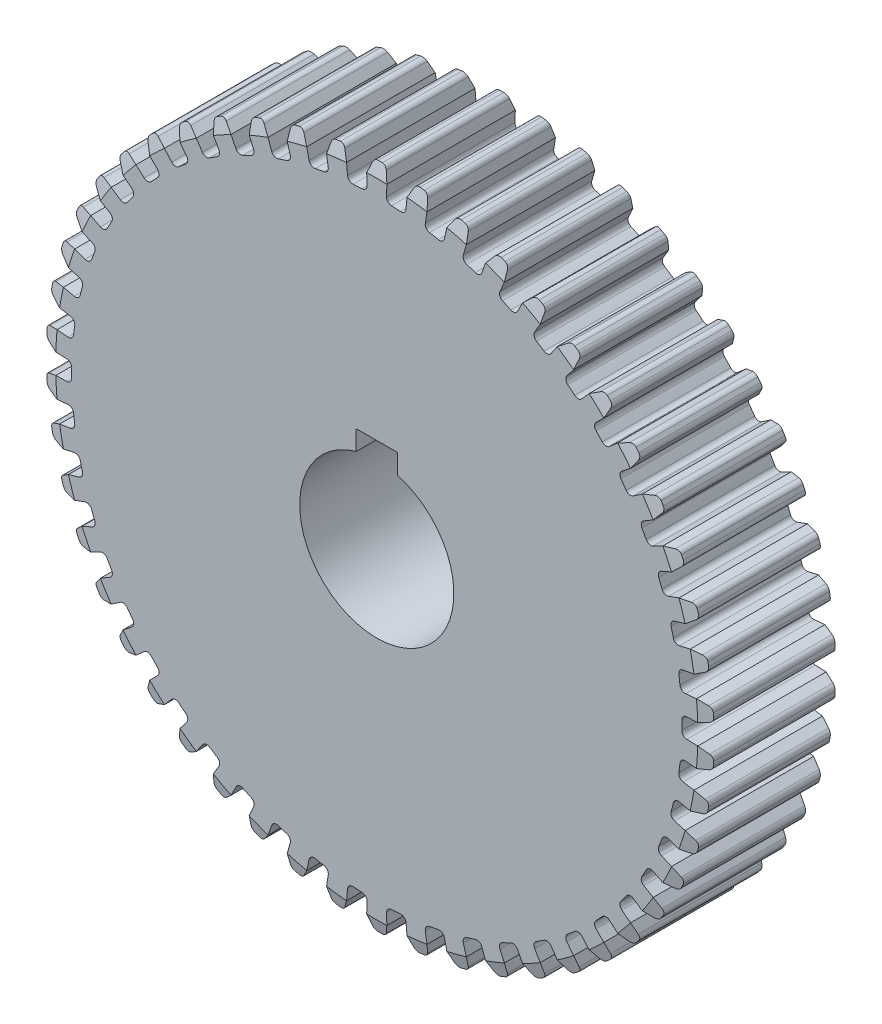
from build123d import *

# Parameters (mm, degrees)
SKETCH2_R          = 70
CUT_EXTRUDE1_DEPTH = 25
CUT_EXTRUDE2_DEPTH = 34
SKETCH5_R          = 31.080505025
CUT_EXTRUDE3_DEPTH = 15.875


with BuildPart() as part:
    # Sketch1 → Revolve1 (revolve)
    with BuildSketch(Plane(origin=(0, 0, 0), x_dir=(0, 0, -1), z_dir=(1, 0, 0)), mode=Mode.PRIVATE) as revolve1_sk:
        Polygon((-34, 15.3), (-33.7, 15), (-0.3, 15), (0, 15.3), (0, 62.5), (-1.205771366, 67), (-23.794228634, 67), (-25, 62.5), (-25, 22), (-33.5, 22), (-34, 21.5), align=None)
    revolve(revolve1_sk.sketch.rotate(Axis((0, 0, 0), (0, 0, 1)), 270), axis=Axis((0, 0, 0), (0, 0, 1)))

    # Sketch2 → Cut-Extrude1 (cut)
    with BuildSketch(Plane.XY):
        Circle(SKETCH2_R)
        with BuildLine():
            Line((-64.09888963, -5.393038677), (-62.222622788, -5.881769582))
            Line((-62.222622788, -5.881769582), (-60.098808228, -5.681009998))
            ThreePointArc((-60.098808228, -5.681009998), (-59.373679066, -5.90080609), (-59.010833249, -6.56598692))
            ThreePointArc((-59.010833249, -6.56598692), (-58.906810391, -7.441660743), (-58.789793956, -8.315693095))
            ThreePointArc((-58.789793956, -8.315693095), (-58.975816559, -9.050212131), (-59.623503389, -9.443435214))
            Line((-59.623503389, -9.443435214), (-61.730521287, -9.777154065))
            Line((-61.730521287, -9.777154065), (-63.426299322, -10.717139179))
            ThreePointArc((-63.426299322, -10.717139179), (-63.845702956, -11.16467764), (-63.924950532, -11.772879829))
            ThreePointArc((-63.924950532, -11.772879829), (-63.848671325, -12.179785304), (-63.769802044, -12.586196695))
            ThreePointArc((-63.769802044, -12.586196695), (-63.472225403, -13.122515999), (-62.917523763, -13.384234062))
            Line((-62.917523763, -13.384234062), (-60.994797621, -13.633952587))
            Line((-60.994797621, -13.633952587), (-58.912891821, -13.168591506))
            ThreePointArc((-58.912891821, -13.168591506), (-58.165932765, -13.295771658), (-57.722578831, -13.910230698))
            ThreePointArc((-57.722578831, -13.910230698), (-57.509625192, -14.76596205), (-57.283986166, -15.618436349))
            ThreePointArc((-57.283986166, -15.618436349), (-57.376482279, -16.370478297), (-57.969777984, -16.841777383))
            Line((-57.969777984, -16.841777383), (-60.018355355, -17.436944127))
            Line((-60.018355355, -17.436944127), (-61.5829503, -18.582054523))
            ThreePointArc((-61.5829503, -18.582054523), (-61.942955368, -19.078629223), (-61.945350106, -19.691967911))
            ThreePointArc((-61.945350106, -19.691967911), (-61.818673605, -20.086104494), (-61.689489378, -20.479426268))
            ThreePointArc((-61.689489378, -20.479426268), (-61.327040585, -20.974220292), (-60.743910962, -21.16435208))
            Line((-60.743910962, -21.16435208), (-58.80504806, -21.171120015))
            Line((-58.80504806, -21.171120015), (-56.797883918, -20.448496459))
            ThreePointArc((-56.797883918, -20.448496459), (-56.040874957, -20.481054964), (-55.524004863, -21.035101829))
            ThreePointArc((-55.524004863, -21.035101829), (-55.20547885, -21.857395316), (-54.874775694, -22.674867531))
            ThreePointArc((-54.874775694, -22.674867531), (-54.872286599, -23.432572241), (-55.401834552, -23.974514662))
            Line((-55.401834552, -23.974514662), (-57.359664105, -24.821743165))
            Line((-57.359664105, -24.821743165), (-58.768401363, -26.153919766))
            ThreePointArc((-58.768401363, -26.153919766), (-59.063330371, -26.691699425), (-58.988834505, -27.300501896))
            ThreePointArc((-58.988834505, -27.300501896), (-58.813758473, -27.675653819), (-58.636296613, -28.049683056))
            ThreePointArc((-58.636296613, -28.049683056), (-58.214691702, -28.495148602), (-57.612330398, -28.610695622))
            Line((-57.612330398, -28.610695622), (-55.687907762, -28.374406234))
            Line((-55.687907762, -28.374406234), (-53.787139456, -27.405916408))
            ThreePointArc((-53.787139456, -27.405916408), (-53.032019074, -27.343339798), (-52.44978417, -27.828236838))
            ThreePointArc((-52.44978417, -27.828236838), (-52.030708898, -28.604124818), (-51.600156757, -29.373703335))
            ThreePointArc((-51.600156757, -29.373703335), (-51.502722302, -30.125120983), (-51.960171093, -30.729159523))
            Line((-51.960171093, -30.729159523), (-53.796376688, -31.815088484))
            Line((-53.796376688, -31.815088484), (-55.02703963, -33.313322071))
            ThreePointArc((-55.02703963, -33.313322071), (-55.252241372, -33.883825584), (-55.102029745, -34.478490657))
            ThreePointArc((-55.102029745, -34.478490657), (-54.881315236, -34.828741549), (-54.658374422, -35.177579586))
            ThreePointArc((-54.658374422, -35.177579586), (-54.184262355, -35.566691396), (-53.572168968, -35.605831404))
            Line((-53.572168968, -35.605831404), (-51.692535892, -35.130211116))
            Line((-51.692535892, -35.130211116), (-49.928139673, -33.931128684))
            ThreePointArc((-49.928139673, -33.931128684), (-49.18681657, -33.77440383), (-48.548399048, -34.182503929))
            ThreePointArc((-48.548399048, -34.182503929), (-48.035384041, -34.899749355), (-47.51177346, -35.609296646))
            ThreePointArc((-47.51177346, -35.609296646), (-47.320929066, -36.342577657), (-47.699064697, -36.999187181))
            Line((-47.699064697, -36.999187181), (-49.384688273, -38.306690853))
            Line((-49.384688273, -38.306690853), (-50.417868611, -39.947353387))
            ThreePointArc((-50.417868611, -39.947353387), (-50.569791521, -40.541583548), (-50.346233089, -41.112732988))
            ThreePointArc((-50.346233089, -41.112732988), (-50.083360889, -41.432559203), (-49.818457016, -41.750704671))
            ThreePointArc((-49.818457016, -41.750704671), (-49.299314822, -42.07732622), (-48.687142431, -42.039441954))
            Line((-48.687142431, -42.039441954), (-46.881941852, -41.331991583))
            Line((-46.881941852, -41.331991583), (-45.281743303, -39.92122679))
            ThreePointArc((-45.281743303, -39.92122679), (-44.565908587, -39.672825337), (-43.881376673, -39.997692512))
            ThreePointArc((-43.881376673, -39.997692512), (-43.282512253, -40.644984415), (-42.674100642, -41.283310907))
            ThreePointArc((-42.674100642, -41.283310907), (-42.392856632, -41.986890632), (-42.685715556, -42.685715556))
            Line((-42.685715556, -42.685715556), (-44.194173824, -44.194173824))
            Line((-44.194173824, -44.194173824), (-45.013577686, -45.951391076))
            ThreePointArc((-45.013577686, -45.951391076), (-45.08982585, -46.559976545), (-44.796446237, -47.098603))
            ThreePointArc((-44.796446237, -47.098603), (-44.495562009, -47.382960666), (-44.192872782, -47.665396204))
            ThreePointArc((-44.192872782, -47.665396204), (-43.636887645, -47.924376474), (-43.034290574, -47.810065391))
            Line((-43.034290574, -47.810065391), (-41.331991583, -46.881941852))
            Line((-41.331991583, -46.881941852), (-39.92122679, -45.281743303))
            ThreePointArc((-39.92122679, -45.281743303), (-39.242169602, -44.945582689), (-38.522318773, -45.182093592))
            ThreePointArc((-38.522318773, -45.182093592), (-37.847049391, -45.74922379), (-37.163431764, -46.306262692))
            ThreePointArc((-37.163431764, -46.306262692), (-36.796223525, -46.96904526), (-36.999187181, -47.699064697))
            Line((-36.999187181, -47.699064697), (-38.306690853, -49.384688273))
            Line((-38.306690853, -49.384688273), (-38.899395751, -51.230747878))
            ThreePointArc((-38.899395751, -51.230747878), (-38.898766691, -51.844090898), (-38.540192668, -52.341699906))
            ThreePointArc((-38.540192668, -52.341699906), (-38.206041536, -52.586104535), (-37.870340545, -52.828375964))
            ThreePointArc((-37.870340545, -52.828375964), (-37.286280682, -53.015630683), (-36.702762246, -52.826695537))
            Line((-36.702762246, -52.826695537), (-35.130211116, -51.692535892))
            Line((-35.130211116, -51.692535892), (-33.931128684, -49.928139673))
            ThreePointArc((-33.931128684, -49.928139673), (-33.299558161, -49.509521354), (-32.555740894, -49.653946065))
            ThreePointArc((-32.555740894, -49.653946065), (-31.814715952, -50.131970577), (-31.066673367, -50.598937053))
            ThreePointArc((-31.066673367, -50.598937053), (-30.619291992, -51.210469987), (-30.729159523, -51.960171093))
            Line((-30.729159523, -51.960171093), (-31.815088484, -53.796376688))
            Line((-31.815088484, -53.796376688), (-32.171747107, -55.702165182))
            ThreePointArc((-32.171747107, -55.702165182), (-32.094250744, -56.310592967), (-31.676137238, -56.759336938))
            ThreePointArc((-31.676137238, -56.759336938), (-31.313988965, -56.959934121), (-30.950570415, -57.158220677))
            ThreePointArc((-30.950570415, -57.158220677), (-30.347646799, -57.270796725), (-29.792409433, -57.010217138))
            Line((-29.792409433, -57.010217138), (-28.374406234, -55.687907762))
            Line((-28.374406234, -55.687907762), (-27.405916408, -53.787139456))
            ThreePointArc((-27.405916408, -53.787139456), (-26.831792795, -53.292665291), (-26.075739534, -53.342726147))
            ThreePointArc((-26.075739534, -53.342726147), (-25.280645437, -53.72410624), (-24.479974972, -54.093635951))
            ThreePointArc((-24.479974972, -54.093635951), (-23.959475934, -54.64427501), (-23.974514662, -55.401834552))
            Line((-23.974514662, -55.401834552), (-24.821743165, -57.359664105))
            Line((-24.821743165, -57.359664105), (-24.936730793, -59.295126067))
            ThreePointArc((-24.936730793, -59.295126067), (-24.783589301, -59.88904333), (-24.312530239, -60.281845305))
            ThreePointArc((-24.312530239, -60.281845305), (-23.928096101, -60.435471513), (-23.542691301, -60.586646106))
            ThreePointArc((-23.542691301, -60.586646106), (-22.930412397, -60.622768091), (-22.412212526, -60.294653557))
            Line((-22.412212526, -60.294653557), (-21.171120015, -58.80504806))
            Line((-21.171120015, -58.80504806), (-20.448496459, -56.797883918))
            ThreePointArc((-20.448496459, -56.797883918), (-19.940874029, -56.23535206), (-19.184508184, -56.190259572))
            ThreePointArc((-19.184508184, -56.190259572), (-18.347884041, -56.468980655), (-17.507212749, -56.735245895))
            ThreePointArc((-17.507212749, -56.735245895), (-16.921804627, -57.216307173), (-16.841777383, -57.969777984))
            Line((-16.841777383, -57.969777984), (-17.436944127, -60.018355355))
            Line((-17.436944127, -60.018355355), (-17.308447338, -61.952967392))
            ThreePointArc((-17.308447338, -61.952967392), (-17.082075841, -62.523007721), (-16.565500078, -62.853672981))
            ThreePointArc((-16.565500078, -62.853672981), (-16.16484285, -62.957905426), (-15.763529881, -63.059583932))
            ThreePointArc((-15.763529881, -63.059583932), (-15.151551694, -63.018682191), (-14.678561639, -62.628207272))
            Line((-14.678561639, -62.628207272), (-13.633952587, -60.994797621))
            Line((-13.633952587, -60.994797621), (-13.168591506, -58.912891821))
            ThreePointArc((-13.168591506, -58.912891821), (-12.735475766, -58.291173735), (-11.99072568, -58.151639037))
            ThreePointArc((-11.99072568, -58.151639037), (-11.125765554, -58.323305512), (-10.258351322, -58.48210712))
            ThreePointArc((-10.258351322, -58.48210712), (-9.617266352, -58.886003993), (-9.443435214, -59.623503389))
            Line((-9.443435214, -59.623503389), (-9.777154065, -61.730521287))
            Line((-9.777154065, -61.730521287), (-9.407199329, -63.633773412))
            ThreePointArc((-9.407199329, -63.633773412), (-9.111167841, -64.170946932), (-8.557222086, -64.434260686))
            ThreePointArc((-8.557222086, -64.434260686), (-8.14666037, -64.487455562), (-7.735768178, -64.53803445))
            ThreePointArc((-7.735768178, -64.53803445), (-7.133741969, -64.420754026), (-6.713421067, -63.974076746))
            Line((-6.713421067, -63.974076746), (-5.881769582, -62.222622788))
            Line((-5.881769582, -62.222622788), (-5.681009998, -60.098808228))
            ThreePointArc((-5.681009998, -60.098808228), (-5.329231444, -59.427708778), (-4.607842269, -59.195932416))
            ThreePointArc((-4.607842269, -59.195932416), (-3.728187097, -59.257837), (-2.847709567, -59.306670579))
            ThreePointArc((-2.847709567, -59.306670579), (-2.161058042, -59.627033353), (-1.896164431, -60.336930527))
            Line((-1.896164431, -60.336930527), (-1.963172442, -62.469160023))
            Line((-1.963172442, -62.469160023), (-1.357594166, -64.311036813))
            ThreePointArc((-1.357594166, -64.311036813), (-0.996571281, -64.806871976), (-0.41399159, -64.998681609))
            ThreePointArc((-0.41399159, -64.998681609), (-1.9e-07, -65), (0.41399121, -64.998681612))
            ThreePointArc((0.41399121, -64.998681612), (0.996571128, -64.806872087), (1.357594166, -64.311036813))
            Line((1.357594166, -64.311036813), (1.963172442, -62.469160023))
            Line((1.963172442, -62.469160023), (1.896164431, -60.336930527))
            ThreePointArc((1.896164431, -60.336930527), (2.161058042, -59.627033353), (2.847709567, -59.306670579))
            ThreePointArc((2.847709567, -59.306670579), (3.728187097, -59.257837), (4.607842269, -59.195932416))
            ThreePointArc((4.607842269, -59.195932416), (5.329231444, -59.427708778), (5.681009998, -60.098808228))
            Line((5.681009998, -60.098808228), (5.881769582, -62.222622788))
            Line((5.881769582, -62.222622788), (6.713421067, -63.974076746))
            ThreePointArc((6.713421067, -63.974076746), (7.133741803, -64.420753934), (7.735767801, -64.538034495))
            ThreePointArc((7.735767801, -64.538034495), (8.146659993, -64.487455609), (8.55722171, -64.434260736))
            ThreePointArc((8.55722171, -64.434260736), (9.111167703, -64.170947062), (9.407199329, -63.633773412))
            Line((9.407199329, -63.633773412), (9.777154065, -61.730521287))
            Line((9.777154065, -61.730521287), (9.443435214, -59.623503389))
            ThreePointArc((9.443435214, -59.623503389), (9.617266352, -58.886003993), (10.258351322, -58.48210712))
            ThreePointArc((10.258351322, -58.48210712), (11.125765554, -58.323305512), (11.99072568, -58.151639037))
            ThreePointArc((11.99072568, -58.151639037), (12.735475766, -58.291173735), (13.168591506, -58.912891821))
            Line((13.168591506, -58.912891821), (13.633952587, -60.994797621))
            Line((13.633952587, -60.994797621), (14.678561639, -62.628207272))
            ThreePointArc((14.678561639, -62.628207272), (15.151551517, -63.01868212), (15.763529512, -63.059584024))
            ThreePointArc((15.763529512, -63.059584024), (16.164842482, -62.957905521), (16.565499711, -62.853673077))
            ThreePointArc((16.565499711, -62.853673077), (17.08207572, -62.523007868), (17.308447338, -61.952967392))
            Line((17.308447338, -61.952967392), (17.436944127, -60.018355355))
            Line((17.436944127, -60.018355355), (16.841777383, -57.969777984))
            ThreePointArc((16.841777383, -57.969777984), (16.921804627, -57.216307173), (17.507212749, -56.735245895))
            ThreePointArc((17.507212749, -56.735245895), (18.347884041, -56.468980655), (19.184508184, -56.190259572))
            ThreePointArc((19.184508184, -56.190259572), (19.940874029, -56.23535206), (20.448496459, -56.797883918))
            Line((20.448496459, -56.797883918), (21.171120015, -58.80504806))
            Line((21.171120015, -58.80504806), (22.412212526, -60.294653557))
            ThreePointArc((22.412212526, -60.294653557), (22.930412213, -60.622768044), (23.542690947, -60.586646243))
            ThreePointArc((23.542690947, -60.586646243), (23.928095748, -60.435471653), (24.312529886, -60.281845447))
            ThreePointArc((24.312529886, -60.281845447), (24.783589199, -59.88904349), (24.936730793, -59.295126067))
            Line((24.936730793, -59.295126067), (24.821743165, -57.359664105))
            Line((24.821743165, -57.359664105), (23.974514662, -55.401834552))
            ThreePointArc((23.974514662, -55.401834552), (23.959475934, -54.64427501), (24.479974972, -54.093635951))
            ThreePointArc((24.479974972, -54.093635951), (25.280645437, -53.72410624), (26.075739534, -53.342726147))
            ThreePointArc((26.075739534, -53.342726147), (26.831792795, -53.292665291), (27.405916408, -53.787139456))
            Line((27.405916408, -53.787139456), (28.374406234, -55.687907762))
            Line((28.374406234, -55.687907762), (29.792409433, -57.010217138))
            ThreePointArc((29.792409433, -57.010217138), (30.347646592, -57.270796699), (30.950570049, -57.158220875))
            ThreePointArc((30.950570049, -57.158220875), (31.313988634, -56.959934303), (31.676136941, -56.759337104))
            ThreePointArc((31.676136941, -56.759337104), (32.094250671, -56.310593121), (32.171747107, -55.702165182))
            Line((32.171747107, -55.702165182), (31.815088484, -53.796376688))
            Line((31.815088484, -53.796376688), (30.729159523, -51.960171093))
            ThreePointArc((30.729159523, -51.960171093), (30.619291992, -51.210469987), (31.066673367, -50.598937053))
            ThreePointArc((31.066673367, -50.598937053), (31.814715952, -50.131970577), (32.555740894, -49.653946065))
            ThreePointArc((32.555740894, -49.653946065), (33.299558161, -49.509521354), (33.931128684, -49.928139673))
            Line((33.931128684, -49.928139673), (35.130211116, -51.692535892))
            Line((35.130211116, -51.692535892), (36.702762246, -52.826695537))
            ThreePointArc((36.702762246, -52.826695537), (37.28628089, -53.015630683), (37.870340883, -52.828375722))
            ThreePointArc((37.870340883, -52.828375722), (38.206041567, -52.586104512), (38.540192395, -52.341700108))
            ThreePointArc((38.540192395, -52.341700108), (38.898766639, -51.844091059), (38.899395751, -51.230747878))
            Line((38.899395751, -51.230747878), (38.306690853, -49.384688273))
            Line((38.306690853, -49.384688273), (36.999187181, -47.699064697))
            ThreePointArc((36.999187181, -47.699064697), (36.796223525, -46.96904526), (37.163431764, -46.306262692))
            ThreePointArc((37.163431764, -46.306262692), (37.847049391, -45.74922379), (38.522318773, -45.182093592))
            ThreePointArc((38.522318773, -45.182093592), (39.242169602, -44.945582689), (39.92122679, -45.281743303))
            Line((39.92122679, -45.281743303), (41.331991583, -46.881941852))
            Line((41.331991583, -46.881941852), (43.034290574, -47.810065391))
            ThreePointArc((43.034290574, -47.810065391), (43.636887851, -47.924376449), (44.192873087, -47.665395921))
            ThreePointArc((44.192873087, -47.665395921), (44.495562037, -47.38296064), (44.796445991, -47.098603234))
            ThreePointArc((44.796445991, -47.098603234), (45.089825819, -46.559976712), (45.013577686, -45.951391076))
            Line((45.013577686, -45.951391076), (44.194173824, -44.194173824))
            Line((44.194173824, -44.194173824), (42.685715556, -42.685715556))
            ThreePointArc((42.685715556, -42.685715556), (42.392856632, -41.986890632), (42.674100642, -41.283310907))
            ThreePointArc((42.674100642, -41.283310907), (43.282512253, -40.644984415), (43.881376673, -39.997692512))
            ThreePointArc((43.881376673, -39.997692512), (44.565908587, -39.672825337), (45.281743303, -39.92122679))
            Line((45.281743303, -39.92122679), (46.881941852, -41.331991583))
            Line((46.881941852, -41.331991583), (48.687142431, -42.039441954))
            ThreePointArc((48.687142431, -42.039441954), (49.299315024, -42.077326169), (49.818457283, -41.750704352))
            ThreePointArc((49.818457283, -41.750704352), (50.083360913, -41.432559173), (50.346232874, -41.112733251))
            ThreePointArc((50.346232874, -41.112733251), (50.56979151, -40.541583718), (50.417868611, -39.947353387))
            Line((50.417868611, -39.947353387), (49.384688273, -38.306690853))
            Line((49.384688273, -38.306690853), (47.699064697, -36.999187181))
            ThreePointArc((47.699064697, -36.999187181), (47.320929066, -36.342577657), (47.51177346, -35.609296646))
            ThreePointArc((47.51177346, -35.609296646), (48.035384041, -34.899749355), (48.548399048, -34.182503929))
            ThreePointArc((48.548399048, -34.182503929), (49.18681657, -33.77440383), (49.928139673, -33.931128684))
            Line((49.928139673, -33.931128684), (51.692535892, -35.130211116))
            Line((51.692535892, -35.130211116), (53.572168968, -35.605831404))
            ThreePointArc((53.572168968, -35.605831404), (54.184262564, -35.566691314), (54.658374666, -35.177579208))
            ThreePointArc((54.658374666, -35.177579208), (54.881315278, -34.828741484), (55.102029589, -34.478490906))
            ThreePointArc((55.102029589, -34.478490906), (55.252241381, -33.88382573), (55.02703963, -33.313322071))
            Line((55.02703963, -33.313322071), (53.796376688, -31.815088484))
            Line((53.796376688, -31.815088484), (51.960171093, -30.729159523))
            ThreePointArc((51.960171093, -30.729159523), (51.50272218, -30.125120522), (51.600157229, -29.373702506))
            ThreePointArc((51.600157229, -29.373702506), (52.030709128, -28.6041244), (52.44978417, -27.828236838))
            ThreePointArc((52.44978417, -27.828236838), (53.032019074, -27.343339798), (53.787139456, -27.405916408))
            Line((53.787139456, -27.405916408), (55.687907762, -28.374406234))
            Line((55.687907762, -28.374406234), (57.612330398, -28.610695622))
            ThreePointArc((57.612330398, -28.610695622), (58.214691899, -28.495148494), (58.636296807, -28.04968265))
            ThreePointArc((58.636296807, -28.04968265), (58.813758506, -27.675653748), (58.988834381, -27.300502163))
            ThreePointArc((58.988834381, -27.300502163), (59.063330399, -26.69169957), (58.768401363, -26.153919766))
            Line((58.768401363, -26.153919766), (57.359664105, -24.821743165))
            Line((57.359664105, -24.821743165), (55.401834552, -23.974514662))
            ThreePointArc((55.401834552, -23.974514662), (54.872286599, -23.432572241), (54.874775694, -22.674867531))
            ThreePointArc((54.874775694, -22.674867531), (55.20547885, -21.857395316), (55.524004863, -21.035101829))
            ThreePointArc((55.524004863, -21.035101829), (56.040874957, -20.481054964), (56.797883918, -20.448496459))
            Line((56.797883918, -20.448496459), (58.80504806, -21.171120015))
            Line((58.80504806, -21.171120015), (60.743910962, -21.16435208))
            ThreePointArc((60.743910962, -21.16435208), (61.327040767, -20.97422016), (61.68948952, -20.479425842))
            ThreePointArc((61.68948952, -20.479425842), (61.818673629, -20.086104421), (61.945350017, -19.691968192))
            ThreePointArc((61.945350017, -19.691968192), (61.942955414, -19.078629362), (61.5829503, -18.582054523))
            Line((61.5829503, -18.582054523), (60.018355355, -17.436944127))
            Line((60.018355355, -17.436944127), (57.969777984, -16.841777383))
            ThreePointArc((57.969777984, -16.841777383), (57.376482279, -16.370478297), (57.283986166, -15.618436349))
            ThreePointArc((57.283986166, -15.618436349), (57.509625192, -14.76596205), (57.722578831, -13.910230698))
            ThreePointArc((57.722578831, -13.910230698), (58.165932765, -13.295771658), (58.912891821, -13.168591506))
            Line((58.912891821, -13.168591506), (60.994797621, -13.633952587))
            Line((60.994797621, -13.633952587), (62.917523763, -13.384234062))
            ThreePointArc((62.917523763, -13.384234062), (63.472225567, -13.122515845), (63.769802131, -12.586196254))
            ThreePointArc((63.769802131, -12.586196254), (63.848671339, -12.179785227), (63.924950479, -11.772880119))
            ThreePointArc((63.924950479, -11.772880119), (63.845703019, -11.164677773), (63.426299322, -10.717139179))
            Line((63.426299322, -10.717139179), (61.730521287, -9.777154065))
            Line((61.730521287, -9.777154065), (59.623503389, -9.443435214))
            ThreePointArc((59.623503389, -9.443435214), (58.975816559, -9.050212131), (58.789793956, -8.315693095))
            ThreePointArc((58.789793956, -8.315693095), (58.906810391, -7.441660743), (59.010833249, -6.56598692))
            ThreePointArc((59.010833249, -6.56598692), (59.373679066, -5.90080609), (60.098808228, -5.681009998))
            Line((60.098808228, -5.681009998), (62.222622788, -5.881769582))
            Line((62.222622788, -5.881769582), (64.09888963, -5.393038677))
            ThreePointArc((64.09888963, -5.393038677), (64.616415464, -5.063861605), (64.844426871, -4.494474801))
            ThreePointArc((64.844426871, -4.494474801), (64.871737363, -4.08138353), (64.896416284, -3.668126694))
            ThreePointArc((64.896416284, -3.668126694), (64.741565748, -3.074652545), (64.269377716, -2.683208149))
            Line((64.269377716, -2.683208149), (62.469160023, -1.963172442))
            Line((62.469160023, -1.963172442), (60.336930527, -1.896164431))
            ThreePointArc((60.336930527, -1.896164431), (59.645066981, -1.587218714), (59.368451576, -0.881806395))
            ThreePointArc((59.368451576, -0.881806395), (59.375, 0), (59.368451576, 0.881806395))
            ThreePointArc((59.368451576, 0.881806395), (59.645066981, 1.587218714), (60.336930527, 1.896164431))
            Line((60.336930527, 1.896164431), (62.469160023, 1.963172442))
            Line((62.469160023, 1.963172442), (64.269377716, 2.683208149))
            ThreePointArc((64.269377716, 2.683208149), (64.741565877, 3.074652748), (64.896416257, 3.668127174))
            ThreePointArc((64.896416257, 3.668127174), (64.871737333, 4.081384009), (64.844426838, 4.49447528))
            ThreePointArc((64.844426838, 4.49447528), (64.61641531, 5.06386179), (64.09888963, 5.393038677))
            Line((64.09888963, 5.393038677), (62.222622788, 5.881769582))
            Line((62.222622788, 5.881769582), (60.098808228, 5.681009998))
            ThreePointArc((60.098808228, 5.681009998), (59.373679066, 5.90080609), (59.010833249, 6.56598692))
            ThreePointArc((59.010833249, 6.56598692), (58.906810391, 7.441660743), (58.789793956, 8.315693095))
            ThreePointArc((58.789793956, 8.315693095), (58.975816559, 9.050212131), (59.623503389, 9.443435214))
            Line((59.623503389, 9.443435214), (61.730521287, 9.777154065))
            Line((61.730521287, 9.777154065), (63.426299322, 10.717139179))
            ThreePointArc((63.426299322, 10.717139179), (63.845703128, 11.164678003), (63.924950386, 11.77288062))
            ThreePointArc((63.924950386, 11.77288062), (63.84867125, 12.179785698), (63.769802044, 12.586196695))
            ThreePointArc((63.769802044, 12.586196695), (63.472225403, 13.122515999), (62.917523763, 13.384234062))
            Line((62.917523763, 13.384234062), (60.994797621, 13.633952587))
            Line((60.994797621, 13.633952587), (58.912891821, 13.168591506))
            ThreePointArc((58.912891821, 13.168591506), (58.165932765, 13.295771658), (57.722578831, 13.910230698))
            ThreePointArc((57.722578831, 13.910230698), (57.509625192, 14.76596205), (57.283986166, 15.618436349))
            ThreePointArc((57.283986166, 15.618436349), (57.376482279, 16.370478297), (57.969777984, 16.841777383))
            Line((57.969777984, 16.841777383), (60.018355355, 17.436944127))
            Line((60.018355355, 17.436944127), (61.5829503, 18.582054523))
            ThreePointArc((61.5829503, 18.582054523), (61.942955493, 19.078629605), (61.945349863, 19.691968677))
            ThreePointArc((61.945349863, 19.691968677), (61.81867348, 20.086104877), (61.689489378, 20.479426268))
            ThreePointArc((61.689489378, 20.479426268), (61.327040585, 20.974220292), (60.743910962, 21.16435208))
            Line((60.743910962, 21.16435208), (58.80504806, 21.171120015))
            Line((58.80504806, 21.171120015), (56.797883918, 20.448496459))
            ThreePointArc((56.797883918, 20.448496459), (56.040874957, 20.481054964), (55.524004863, 21.035101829))
            ThreePointArc((55.524004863, 21.035101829), (55.20547885, 21.857395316), (54.874775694, 22.674867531))
            ThreePointArc((54.874775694, 22.674867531), (54.872286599, 23.432572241), (55.401834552, 23.974514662))
            Line((55.401834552, 23.974514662), (57.359664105, 24.821743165))
            Line((57.359664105, 24.821743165), (58.768401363, 26.153919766))
            ThreePointArc((58.768401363, 26.153919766), (59.063330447, 26.69169982), (58.988834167, 27.300502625))
            ThreePointArc((58.988834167, 27.300502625), (58.813758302, 27.675654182), (58.636296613, 28.049683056))
            ThreePointArc((58.636296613, 28.049683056), (58.214691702, 28.495148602), (57.612330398, 28.610695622))
            Line((57.612330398, 28.610695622), (55.687907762, 28.374406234))
            Line((55.687907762, 28.374406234), (53.787139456, 27.405916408))
            ThreePointArc((53.787139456, 27.405916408), (53.032019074, 27.343339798), (52.44978417, 27.828236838))
            ThreePointArc((52.44978417, 27.828236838), (52.030709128, 28.6041244), (51.600157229, 29.373702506))
            ThreePointArc((51.600157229, 29.373702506), (51.50272218, 30.125120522), (51.960171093, 30.729159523))
            Line((51.960171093, 30.729159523), (53.796376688, 31.815088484))
            Line((53.796376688, 31.815088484), (55.02703963, 33.313322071))
            ThreePointArc((55.02703963, 33.313322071), (55.252241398, 33.883825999), (55.102029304, 34.478491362))
            ThreePointArc((55.102029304, 34.478491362), (54.881315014, 34.8287419), (54.658374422, 35.177579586))
            ThreePointArc((54.658374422, 35.177579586), (54.184262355, 35.566691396), (53.572168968, 35.605831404))
            Line((53.572168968, 35.605831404), (51.692535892, 35.130211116))
            Line((51.692535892, 35.130211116), (49.928139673, 33.931128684))
            ThreePointArc((49.928139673, 33.931128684), (49.18681657, 33.77440383), (48.548399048, 34.182503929))
            ThreePointArc((48.548399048, 34.182503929), (48.035384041, 34.899749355), (47.51177346, 35.609296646))
            ThreePointArc((47.51177346, 35.609296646), (47.320929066, 36.342577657), (47.699064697, 36.999187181))
            Line((47.699064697, 36.999187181), (49.384688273, 38.306690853))
            Line((49.384688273, 38.306690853), (50.417868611, 39.947353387))
            ThreePointArc((50.417868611, 39.947353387), (50.569791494, 40.541583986), (50.346232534, 41.112733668))
            ThreePointArc((50.346232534, 41.112733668), (50.083360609, 41.432559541), (49.818457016, 41.750704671))
            ThreePointArc((49.818457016, 41.750704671), (49.299314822, 42.07732622), (48.687142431, 42.039441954))
            Line((48.687142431, 42.039441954), (46.881941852, 41.331991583))
            Line((46.881941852, 41.331991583), (45.281743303, 39.92122679))
            ThreePointArc((45.281743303, 39.92122679), (44.565908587, 39.672825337), (43.881376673, 39.997692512))
            ThreePointArc((43.881376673, 39.997692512), (43.282512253, 40.644984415), (42.674100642, 41.283310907))
            ThreePointArc((42.674100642, 41.283310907), (42.392856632, 41.986890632), (42.685715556, 42.685715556))
            Line((42.685715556, 42.685715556), (44.194173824, 44.194173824))
            Line((44.194173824, 44.194173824), (45.013577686, 45.951391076))
            ThreePointArc((45.013577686, 45.951391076), (45.089825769, 46.559976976), (44.796445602, 47.098603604))
            ThreePointArc((44.796445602, 47.098603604), (44.49556169, 47.382960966), (44.192872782, 47.665396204))
            ThreePointArc((44.192872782, 47.665396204), (43.636887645, 47.924376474), (43.034290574, 47.810065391))
            Line((43.034290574, 47.810065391), (41.331991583, 46.881941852))
            Line((41.331991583, 46.881941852), (39.92122679, 45.281743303))
            ThreePointArc((39.92122679, 45.281743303), (39.242169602, 44.945582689), (38.522318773, 45.182093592))
            ThreePointArc((38.522318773, 45.182093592), (37.847049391, 45.74922379), (37.163431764, 46.306262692))
            ThreePointArc((37.163431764, 46.306262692), (36.796223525, 46.96904526), (36.999187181, 47.699064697))
            Line((36.999187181, 47.699064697), (38.306690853, 49.384688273))
            Line((38.306690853, 49.384688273), (38.899395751, 51.230747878))
            ThreePointArc((38.899395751, 51.230747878), (38.898766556, 51.844091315), (38.540191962, 52.341700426))
            ThreePointArc((38.540191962, 52.341700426), (38.206041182, 52.586104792), (37.870340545, 52.828375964))
            ThreePointArc((37.870340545, 52.828375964), (37.286280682, 53.015630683), (36.702762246, 52.826695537))
            Line((36.702762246, 52.826695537), (35.130211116, 51.692535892))
            Line((35.130211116, 51.692535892), (33.931128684, 49.928139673))
            ThreePointArc((33.931128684, 49.928139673), (33.299558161, 49.509521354), (32.555740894, 49.653946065))
            ThreePointArc((32.555740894, 49.653946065), (31.814715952, 50.131970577), (31.066673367, 50.598937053))
            ThreePointArc((31.066673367, 50.598937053), (30.619291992, 51.210469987), (30.729159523, 51.960171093))
            Line((30.729159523, 51.960171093), (31.815088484, 53.796376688))
            Line((31.815088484, 53.796376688), (32.171747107, 55.702165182))
            ThreePointArc((32.171747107, 55.702165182), (32.094250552, 56.310593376), (31.676136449, 56.759337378))
            ThreePointArc((31.676136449, 56.759337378), (31.31398857, 56.959934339), (30.950570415, 57.158220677))
            ThreePointArc((30.950570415, 57.158220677), (30.347646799, 57.270796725), (29.792409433, 57.010217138))
            Line((29.792409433, 57.010217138), (28.374406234, 55.687907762))
            Line((28.374406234, 55.687907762), (27.405916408, 53.787139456))
            ThreePointArc((27.405916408, 53.787139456), (26.831792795, 53.292665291), (26.075739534, 53.342726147))
            ThreePointArc((26.075739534, 53.342726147), (25.280645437, 53.72410624), (24.479974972, 54.093635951))
            ThreePointArc((24.479974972, 54.093635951), (23.959475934, 54.64427501), (23.974514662, 55.401834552))
            Line((23.974514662, 55.401834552), (24.821743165, 57.359664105))
            Line((24.821743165, 57.359664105), (24.936730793, 59.295126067))
            ThreePointArc((24.936730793, 59.295126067), (24.783589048, 59.889043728), (24.312529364, 60.281845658))
            ThreePointArc((24.312529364, 60.281845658), (23.928095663, 60.435471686), (23.542691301, 60.586646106))
            ThreePointArc((23.542691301, 60.586646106), (22.930412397, 60.622768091), (22.412212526, 60.294653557))
            Line((22.412212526, 60.294653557), (21.171120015, 58.80504806))
            Line((21.171120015, 58.80504806), (20.448496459, 56.797883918))
            ThreePointArc((20.448496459, 56.797883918), (19.940874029, 56.23535206), (19.184508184, 56.190259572))
            ThreePointArc((19.184508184, 56.190259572), (18.347884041, 56.468980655), (17.507212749, 56.735245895))
            ThreePointArc((17.507212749, 56.735245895), (16.921804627, 57.216307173), (16.841777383, 57.969777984))
            Line((16.841777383, 57.969777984), (17.436944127, 60.018355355))
            Line((17.436944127, 60.018355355), (17.308447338, 61.952967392))
            ThreePointArc((17.308447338, 61.952967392), (17.082075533, 62.523008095), (16.565499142, 62.853673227))
            ThreePointArc((16.565499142, 62.853673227), (16.164842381, 62.957905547), (15.763529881, 63.059583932))
            ThreePointArc((15.763529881, 63.059583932), (15.151551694, 63.018682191), (14.678561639, 62.628207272))
            Line((14.678561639, 62.628207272), (13.633952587, 60.994797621))
            Line((13.633952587, 60.994797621), (13.168591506, 58.912891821))
            ThreePointArc((13.168591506, 58.912891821), (12.735475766, 58.291173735), (11.99072568, 58.151639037))
            ThreePointArc((11.99072568, 58.151639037), (11.125765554, 58.323305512), (10.258351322, 58.48210712))
            ThreePointArc((10.258351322, 58.48210712), (9.617266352, 58.886003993), (9.443435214, 59.623503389))
            Line((9.443435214, 59.623503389), (9.777154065, 61.730521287))
            Line((9.777154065, 61.730521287), (9.407199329, 63.633773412))
            ThreePointArc((9.407199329, 63.633773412), (9.111167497, 64.170947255), (8.557221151, 64.43426081))
            ThreePointArc((8.557221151, 64.43426081), (8.146659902, 64.487455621), (7.735768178, 64.53803445))
            ThreePointArc((7.735768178, 64.53803445), (7.133741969, 64.420754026), (6.713421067, 63.974076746))
            Line((6.713421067, 63.974076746), (5.881769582, 62.222622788))
            Line((5.881769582, 62.222622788), (5.681009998, 60.098808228))
            ThreePointArc((5.681009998, 60.098808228), (5.329231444, 59.427708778), (4.607842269, 59.195932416))
            ThreePointArc((4.607842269, 59.195932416), (3.728187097, 59.257837), (2.847709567, 59.306670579))
            ThreePointArc((2.847709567, 59.306670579), (2.161058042, 59.627033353), (1.896164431, 60.336930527))
            Line((1.896164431, 60.336930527), (1.963172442, 62.469160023))
            Line((1.963172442, 62.469160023), (1.357594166, 64.311036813))
            ThreePointArc((1.357594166, 64.311036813), (0.9965709, 64.806872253), (0.413990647, 64.998681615))
            ThreePointArc((0.413990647, 64.998681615), (-2.82e-07, 65), (-0.41399121, 64.998681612))
            ThreePointArc((-0.41399121, 64.998681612), (-0.996571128, 64.806872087), (-1.357594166, 64.311036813))
            Line((-1.357594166, 64.311036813), (-1.963172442, 62.469160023))
            Line((-1.963172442, 62.469160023), (-1.896164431, 60.336930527))
            ThreePointArc((-1.896164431, 60.336930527), (-2.161058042, 59.627033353), (-2.847709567, 59.306670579))
            ThreePointArc((-2.847709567, 59.306670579), (-3.728187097, 59.257837), (-4.607842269, 59.195932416))
            ThreePointArc((-4.607842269, 59.195932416), (-5.329231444, 59.427708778), (-5.681009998, 60.098808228))
            Line((-5.681009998, 60.098808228), (-5.881769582, 62.222622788))
            Line((-5.881769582, 62.222622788), (-6.713421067, 63.974076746))
            ThreePointArc((-6.713421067, 63.974076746), (-7.133741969, 64.420754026), (-7.735768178, 64.53803445))
            ThreePointArc((-7.735768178, 64.53803445), (-8.146660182, 64.487455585), (-8.55722171, 64.434260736))
            ThreePointArc((-8.55722171, 64.434260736), (-9.111167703, 64.170947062), (-9.407199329, 63.633773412))
            Line((-9.407199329, 63.633773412), (-9.777154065, 61.730521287))
            Line((-9.777154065, 61.730521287), (-9.443435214, 59.623503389))
            ThreePointArc((-9.443435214, 59.623503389), (-9.617266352, 58.886003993), (-10.258351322, 58.48210712))
            ThreePointArc((-10.258351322, 58.48210712), (-11.125765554, 58.323305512), (-11.99072568, 58.151639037))
            ThreePointArc((-11.99072568, 58.151639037), (-12.735475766, 58.291173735), (-13.168591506, 58.912891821))
            Line((-13.168591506, 58.912891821), (-13.633952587, 60.994797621))
            Line((-13.633952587, 60.994797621), (-14.678561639, 62.628207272))
            ThreePointArc((-14.678561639, 62.628207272), (-15.151551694, 63.018682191), (-15.763529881, 63.059583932))
            ThreePointArc((-15.763529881, 63.059583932), (-16.164842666, 62.957905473), (-16.565499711, 62.853673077))
            ThreePointArc((-16.565499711, 62.853673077), (-17.08207572, 62.523007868), (-17.308447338, 61.952967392))
            Line((-17.308447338, 61.952967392), (-17.436944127, 60.018355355))
            Line((-17.436944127, 60.018355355), (-16.841777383, 57.969777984))
            ThreePointArc((-16.841777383, 57.969777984), (-16.921804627, 57.216307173), (-17.507212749, 56.735245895))
            ThreePointArc((-17.507212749, 56.735245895), (-18.347884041, 56.468980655), (-19.184508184, 56.190259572))
            ThreePointArc((-19.184508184, 56.190259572), (-19.940874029, 56.23535206), (-20.448496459, 56.797883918))
            Line((-20.448496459, 56.797883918), (-21.171120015, 58.80504806))
            Line((-21.171120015, 58.80504806), (-22.412212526, 60.294653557))
            ThreePointArc((-22.412212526, 60.294653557), (-22.930412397, 60.622768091), (-23.542691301, 60.586646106))
            ThreePointArc((-23.542691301, 60.586646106), (-23.928095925, 60.435471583), (-24.312529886, 60.281845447))
            ThreePointArc((-24.312529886, 60.281845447), (-24.783589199, 59.88904349), (-24.936730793, 59.295126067))
            Line((-24.936730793, 59.295126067), (-24.821743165, 57.359664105))
            Line((-24.821743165, 57.359664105), (-23.974514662, 55.401834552))
            ThreePointArc((-23.974514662, 55.401834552), (-23.959475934, 54.64427501), (-24.479974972, 54.093635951))
            ThreePointArc((-24.479974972, 54.093635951), (-25.280645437, 53.72410624), (-26.075739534, 53.342726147))
            ThreePointArc((-26.075739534, 53.342726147), (-26.831792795, 53.292665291), (-27.405916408, 53.787139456))
            Line((-27.405916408, 53.787139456), (-28.374406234, 55.687907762))
            Line((-28.374406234, 55.687907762), (-29.792409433, 57.010217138))
            ThreePointArc((-29.792409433, 57.010217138), (-30.347646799, 57.270796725), (-30.950570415, 57.158220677))
            ThreePointArc((-30.950570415, 57.158220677), (-31.313988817, 56.959934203), (-31.676136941, 56.759337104))
            ThreePointArc((-31.676136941, 56.759337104), (-32.094250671, 56.310593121), (-32.171747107, 55.702165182))
            Line((-32.171747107, 55.702165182), (-31.815088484, 53.796376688))
            Line((-31.815088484, 53.796376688), (-30.729159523, 51.960171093))
            ThreePointArc((-30.729159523, 51.960171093), (-30.619291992, 51.210469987), (-31.066673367, 50.598937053))
            ThreePointArc((-31.066673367, 50.598937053), (-31.814715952, 50.131970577), (-32.555740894, 49.653946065))
            ThreePointArc((-32.555740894, 49.653946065), (-33.299558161, 49.509521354), (-33.931128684, 49.928139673))
            Line((-33.931128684, 49.928139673), (-35.130211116, 51.692535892))
            Line((-35.130211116, 51.692535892), (-36.702762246, 52.826695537))
            ThreePointArc((-36.702762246, 52.826695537), (-37.286280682, 53.015630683), (-37.870340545, 52.828375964))
            ThreePointArc((-37.870340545, 52.828375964), (-38.206041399, 52.586104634), (-38.540192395, 52.341700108))
            ThreePointArc((-38.540192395, 52.341700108), (-38.898766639, 51.844091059), (-38.899395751, 51.230747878))
            Line((-38.899395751, 51.230747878), (-38.306690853, 49.384688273))
            Line((-38.306690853, 49.384688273), (-36.999187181, 47.699064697))
            ThreePointArc((-36.999187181, 47.699064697), (-36.796223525, 46.96904526), (-37.163431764, 46.306262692))
            ThreePointArc((-37.163431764, 46.306262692), (-37.847049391, 45.74922379), (-38.522318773, 45.182093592))
            ThreePointArc((-38.522318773, 45.182093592), (-39.242169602, 44.945582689), (-39.92122679, 45.281743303))
            Line((-39.92122679, 45.281743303), (-41.331991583, 46.881941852))
            Line((-41.331991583, 46.881941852), (-43.034290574, 47.810065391))
            ThreePointArc((-43.034290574, 47.810065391), (-43.636887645, 47.924376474), (-44.192872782, 47.665396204))
            ThreePointArc((-44.192872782, 47.665396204), (-44.495561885, 47.382960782), (-44.796445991, 47.098603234))
            ThreePointArc((-44.796445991, 47.098603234), (-45.089825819, 46.559976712), (-45.013577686, 45.951391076))
            Line((-45.013577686, 45.951391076), (-44.194173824, 44.194173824))
            Line((-44.194173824, 44.194173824), (-42.685715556, 42.685715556))
            ThreePointArc((-42.685715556, 42.685715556), (-42.392856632, 41.986890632), (-42.674100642, 41.283310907))
            ThreePointArc((-42.674100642, 41.283310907), (-43.282512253, 40.644984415), (-43.881376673, 39.997692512))
            ThreePointArc((-43.881376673, 39.997692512), (-44.565908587, 39.672825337), (-45.281743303, 39.92122679))
            Line((-45.281743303, 39.92122679), (-46.881941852, 41.331991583))
            Line((-46.881941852, 41.331991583), (-48.687142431, 42.039441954))
            ThreePointArc((-48.687142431, 42.039441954), (-49.29931474, 42.077326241), (-49.818456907, 41.750704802))
            ThreePointArc((-49.818456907, 41.750704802), (-50.083360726, 41.432559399), (-50.346232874, 41.112733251))
            ThreePointArc((-50.346232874, 41.112733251), (-50.56979151, 40.541583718), (-50.417868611, 39.947353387))
            Line((-50.417868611, 39.947353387), (-49.384688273, 38.306690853))
            Line((-49.384688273, 38.306690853), (-47.699064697, 36.999187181))
            ThreePointArc((-47.699064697, 36.999187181), (-47.320929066, 36.342577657), (-47.51177346, 35.609296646))
            ThreePointArc((-47.51177346, 35.609296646), (-48.035384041, 34.899749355), (-48.548399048, 34.182503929))
            ThreePointArc((-48.548399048, 34.182503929), (-49.18681657, 33.77440383), (-49.928139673, 33.931128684))
            Line((-49.928139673, 33.931128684), (-51.692535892, 35.130211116))
            Line((-51.692535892, 35.130211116), (-53.572168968, 35.605831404))
            ThreePointArc((-53.572168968, 35.605831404), (-54.184262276, 35.566691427), (-54.65837433, 35.177579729))
            ThreePointArc((-54.65837433, 35.177579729), (-54.881315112, 34.828741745), (-55.102029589, 34.478490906))
            ThreePointArc((-55.102029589, 34.478490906), (-55.252241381, 33.88382573), (-55.02703963, 33.313322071))
            Line((-55.02703963, 33.313322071), (-53.796376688, 31.815088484))
            Line((-53.796376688, 31.815088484), (-51.960171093, 30.729159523))
            ThreePointArc((-51.960171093, 30.729159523), (-51.50272218, 30.125120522), (-51.600157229, 29.373702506))
            ThreePointArc((-51.600157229, 29.373702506), (-52.030709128, 28.6041244), (-52.44978417, 27.828236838))
            ThreePointArc((-52.44978417, 27.828236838), (-53.032019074, 27.343339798), (-53.787139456, 27.405916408))
            Line((-53.787139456, 27.405916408), (-55.687907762, 28.374406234))
            Line((-55.687907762, 28.374406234), (-57.612330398, 28.610695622))
            ThreePointArc((-57.612330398, 28.610695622), (-58.214691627, 28.495148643), (-58.636296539, 28.049683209))
            ThreePointArc((-58.636296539, 28.049683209), (-58.813758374, 27.675654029), (-58.988834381, 27.300502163))
            ThreePointArc((-58.988834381, 27.300502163), (-59.063330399, 26.69169957), (-58.768401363, 26.153919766))
            Line((-58.768401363, 26.153919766), (-57.359664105, 24.821743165))
            Line((-57.359664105, 24.821743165), (-55.401834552, 23.974514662))
            ThreePointArc((-55.401834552, 23.974514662), (-54.872286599, 23.432572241), (-54.874775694, 22.674867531))
            ThreePointArc((-54.874775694, 22.674867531), (-55.20547885, 21.857395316), (-55.524004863, 21.035101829))
            ThreePointArc((-55.524004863, 21.035101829), (-56.040874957, 20.481054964), (-56.797883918, 20.448496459))
            Line((-56.797883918, 20.448496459), (-58.80504806, 21.171120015))
            Line((-58.80504806, 21.171120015), (-60.743910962, 21.16435208))
            ThreePointArc((-60.743910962, 21.16435208), (-61.327040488, 20.974220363), (-61.689489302, 20.479426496))
            ThreePointArc((-61.689489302, 20.479426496), (-61.818673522, 20.086104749), (-61.945350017, 19.691968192))
            ThreePointArc((-61.945350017, 19.691968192), (-61.942955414, 19.078629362), (-61.5829503, 18.582054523))
            Line((-61.5829503, 18.582054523), (-60.018355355, 17.436944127))
            Line((-60.018355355, 17.436944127), (-57.969777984, 16.841777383))
            ThreePointArc((-57.969777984, 16.841777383), (-57.376482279, 16.370478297), (-57.283986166, 15.618436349))
            ThreePointArc((-57.283986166, 15.618436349), (-57.509625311, 14.765961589), (-57.722579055, 13.910229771))
            ThreePointArc((-57.722579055, 13.910229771), (-58.165933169, 13.295771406), (-58.912891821, 13.168591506))
            Line((-58.912891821, 13.168591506), (-60.994797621, 13.633952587))
            Line((-60.994797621, 13.633952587), (-62.917523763, 13.384234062))
            ThreePointArc((-62.917523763, 13.384234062), (-63.472225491, 13.122515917), (-63.769802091, 12.586196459))
            ThreePointArc((-63.769802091, 12.586196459), (-63.84867132, 12.17978533), (-63.924950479, 11.772880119))
            ThreePointArc((-63.924950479, 11.772880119), (-63.845703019, 11.164677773), (-63.426299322, 10.717139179))
            Line((-63.426299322, 10.717139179), (-61.730521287, 9.777154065))
            Line((-61.730521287, 9.777154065), (-59.623503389, 9.443435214))
            ThreePointArc((-59.623503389, 9.443435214), (-58.975816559, 9.050212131), (-58.789793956, 8.315693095))
            ThreePointArc((-58.789793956, 8.315693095), (-58.90681045, 7.44166027), (-59.010833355, 6.565985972))
            ThreePointArc((-59.010833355, 6.565985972), (-59.373679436, 5.900805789), (-60.098808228, 5.681009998))
            Line((-60.098808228, 5.681009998), (-62.222622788, 5.881769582))
            Line((-62.222622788, 5.881769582), (-64.09888963, 5.393038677))
            ThreePointArc((-64.09888963, 5.393038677), (-64.616415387, 5.063861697), (-64.844426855, 4.494475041))
            ThreePointArc((-64.844426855, 4.494475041), (-64.871737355, 4.08138365), (-64.896416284, 3.668126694))
            ThreePointArc((-64.896416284, 3.668126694), (-64.741565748, 3.074652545), (-64.269377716, 2.683208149))
            Line((-64.269377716, 2.683208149), (-62.469160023, 1.963172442))
            Line((-62.469160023, 1.963172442), (-60.336930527, 1.896164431))
            ThreePointArc((-60.336930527, 1.896164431), (-59.645066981, 1.587218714), (-59.368451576, 0.881806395))
            ThreePointArc((-59.368451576, 0.881806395), (-59.375, 0), (-59.368451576, -0.881806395))
            ThreePointArc((-59.368451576, -0.881806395), (-59.645066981, -1.587218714), (-60.336930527, -1.896164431))
            Line((-60.336930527, -1.896164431), (-62.469160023, -1.963172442))
            Line((-62.469160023, -1.963172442), (-64.269377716, -2.683208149))
            ThreePointArc((-64.269377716, -2.683208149), (-64.741565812, -3.074652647), (-64.896416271, -3.668126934))
            ThreePointArc((-64.896416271, -3.668126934), (-64.87173734, -4.081383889), (-64.844426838, -4.49447528))
            ThreePointArc((-64.844426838, -4.49447528), (-64.61641531, -5.06386179), (-64.09888963, -5.393038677))
        make_face(mode=Mode.SUBTRACT)
    extrude(amount=CUT_EXTRUDE1_DEPTH, mode=Mode.SUBTRACT)

    # Sketch3 → Cut-Revolve1 (revolve, cut)
    with BuildSketch(Plane.XY.offset(29.5), mode=Mode.PRIVATE) as cut_revolve1_sk:
        Polygon((0, 18.3), (-2.4585, 18.3), (-2.4585, 21.4585), (-3, 22), (0, 22), align=None)
    revolve(cut_revolve1_sk.sketch.rotate(Axis((0, 22, 29.5), (0, -1, 0)), 45.137611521), axis=Axis((0, 22, 29.5), (0, -1, 0)), mode=Mode.SUBTRACT)

    # Sketch4 → Cut-Extrude2 (cut)
    with BuildSketch(Plane.XY):
        with BuildLine():
            Line((-4, 0), (4, 0))
            Line((4, 0), (4, 18.1))
            ThreePointArc((4, 18.1), (3.941421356, 18.241421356), (3.8, 18.3))
            Line((3.8, 18.3), (-3.8, 18.3))
            ThreePointArc((-3.8, 18.3), (-3.941421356, 18.241421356), (-4, 18.1))
            Line((-4, 18.1), (-4, 0))
        make_face()
    extrude(amount=CUT_EXTRUDE2_DEPTH, mode=Mode.SUBTRACT)

    # Sketch5 → Cut-Extrude3 (cut)
    with BuildSketch(Plane.XY.offset(25)):
        Circle(SKETCH5_R)
    extrude(amount=CUT_EXTRUDE3_DEPTH, mode=Mode.SUBTRACT)


solid = part.part
